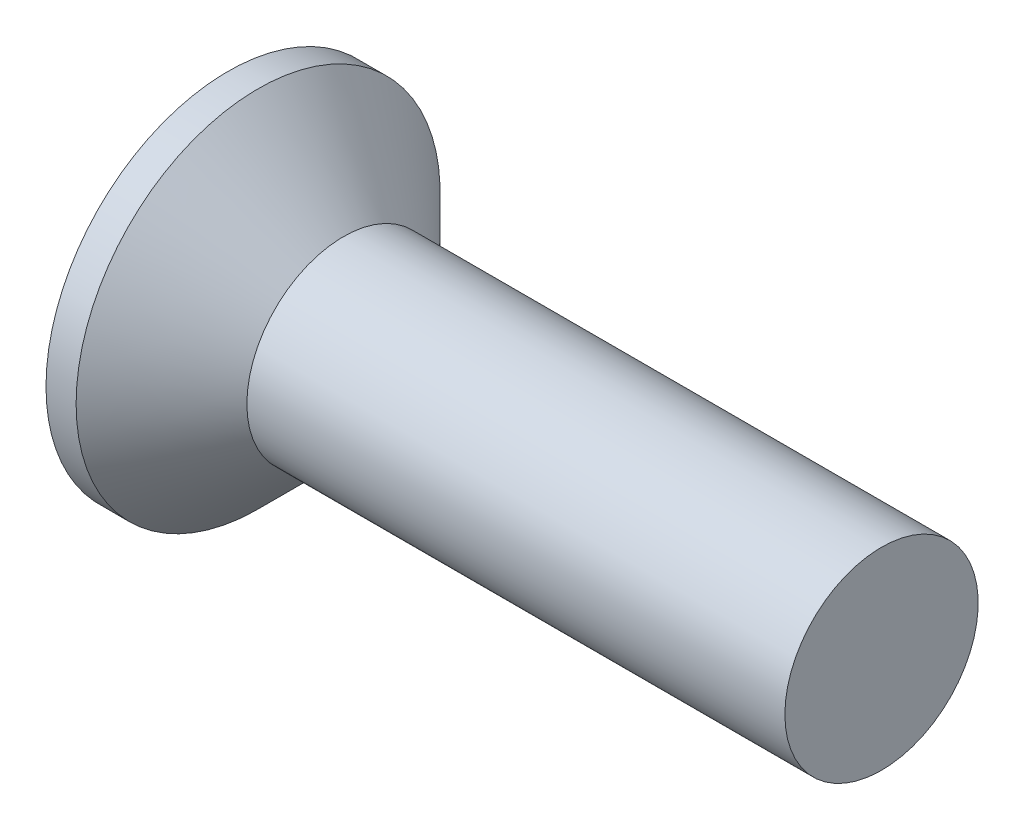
from build123d import *

# Parameters (mm, degrees)
CIRPATTERN1_COUNT = 2
CIRPATTERN1_ANGLE = 90


with BuildPart() as part:
    # BodySke → Base-Revolve (revolve)
    with BuildSketch(Plane.XY, mode=Mode.PRIVATE) as base_revolve_sk:
        with BuildLine():
            Line((0, 0), (21.397407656, 0))
            Line((21.397407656, 0), (21.397407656, 3))
            Line((21.397407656, 3), (4.697407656, 3))
            Line((4.697407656, 3), (2.047407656, 5.65))
            Line((2.047407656, 5.65), (1.112777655, 5.65))
            ThreePointArc((1.112777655, 5.65), (0.280841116, 2.879269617), (0, 0))
        make_face()
    revolve(base_revolve_sk.sketch.rotate(Axis((-15.875, 0, 0), (1, 0, 0)), 90), axis=Axis((-15.875, 0, 0), (1, 0, 0)))

    # Sketch3 → Cross section 0
    with BuildSketch(Plane(origin=(0, 0, 0), x_dir=(0, 0, -1), z_dir=(1, 0, 0))):
        with BuildLine():
            Line((0.595, -3.65), (-0.595, -3.65))
            Line((-0.595, -3.65), (-0.595, 3.65))
            Line((-0.595, 3.65), (0.595, 3.65))
            Line((0.595, 3.65), (0.595, -3.65))
        make_face()
    # Sketch4 → Cross section 1
    with BuildSketch(Plane(origin=(4.26, 0, 0), x_dir=(0, 0, -1), z_dir=(1, 0, 0))):
        with BuildLine():
            Line((0.2975, -0.2975), (-0.2975, -0.2975))
            Line((-0.2975, -0.2975), (-0.2975, 0.2975))
            Line((-0.2975, 0.2975), (0.2975, 0.2975))
            Line((0.2975, 0.2975), (0.2975, -0.2975))
        make_face()
    cross = loft(mode=Mode.SUBTRACT)

    # CirPattern1: Cross ×2 about axis
    cirpattern1_axis = Axis((0, 0, 0), (1, 0, 0))
    for i in range(1, CIRPATTERN1_COUNT):
        add(cross.rotate(cirpattern1_axis, i * CIRPATTERN1_ANGLE / (CIRPATTERN1_COUNT - 1)), mode=Mode.SUBTRACT)


solid = part.part
